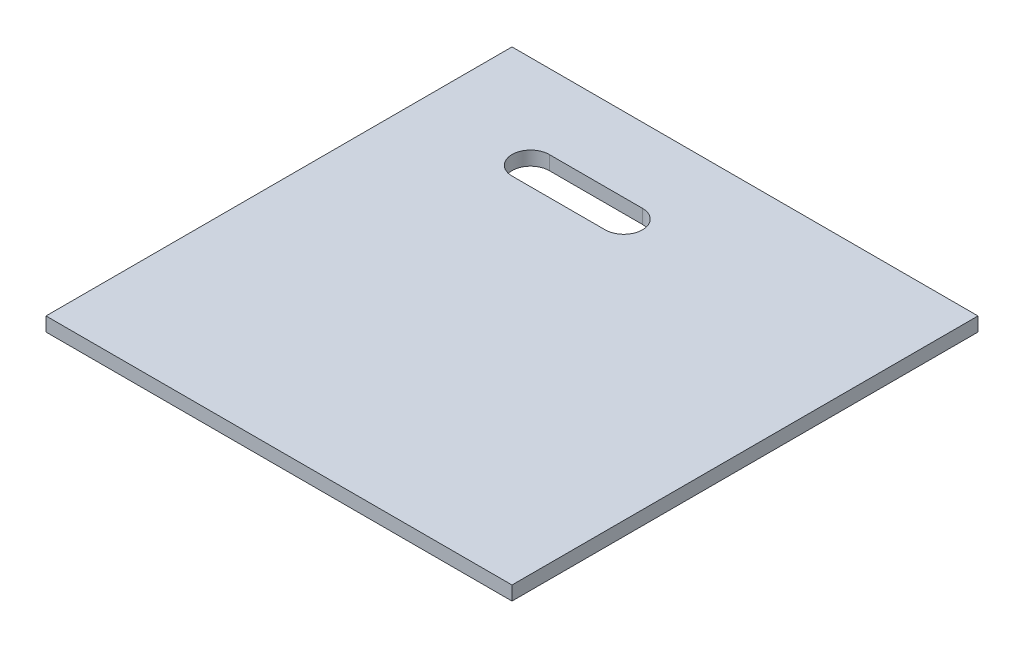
from build123d import *

# Parameters (mm, degrees)
SKETCH1_W      = 500
SKETCH1_H      = 500
EXTRUDE1_DEPTH = 15
EXTRUDE2_DEPTH = 15


with BuildPart() as part:
    # Sketch1 → Extrude1 (new body)
    with BuildSketch(Plane(origin=(0, 0, 0), x_dir=(1, 0, 0), z_dir=(0, 1, 0))):
        Rectangle(SKETCH1_W, SKETCH1_H)
    extrude(amount=EXTRUDE1_DEPTH)

    # Sketch2 → Extrude2 (cut)
    with BuildSketch(Plane(origin=(0, 15, 0), x_dir=(1, 0, 0), z_dir=(0, 1, 0))):
        with BuildLine():
            Line((-130, 130), (-30, 130))
            ThreePointArc((-30, 130), (-10, 150), (-30, 170))
            Line((-30, 170), (-130, 170))
            ThreePointArc((-130, 170), (-150, 150), (-130, 130))
        make_face()
    extrude(amount=-EXTRUDE2_DEPTH, mode=Mode.SUBTRACT)


solid = part.part
